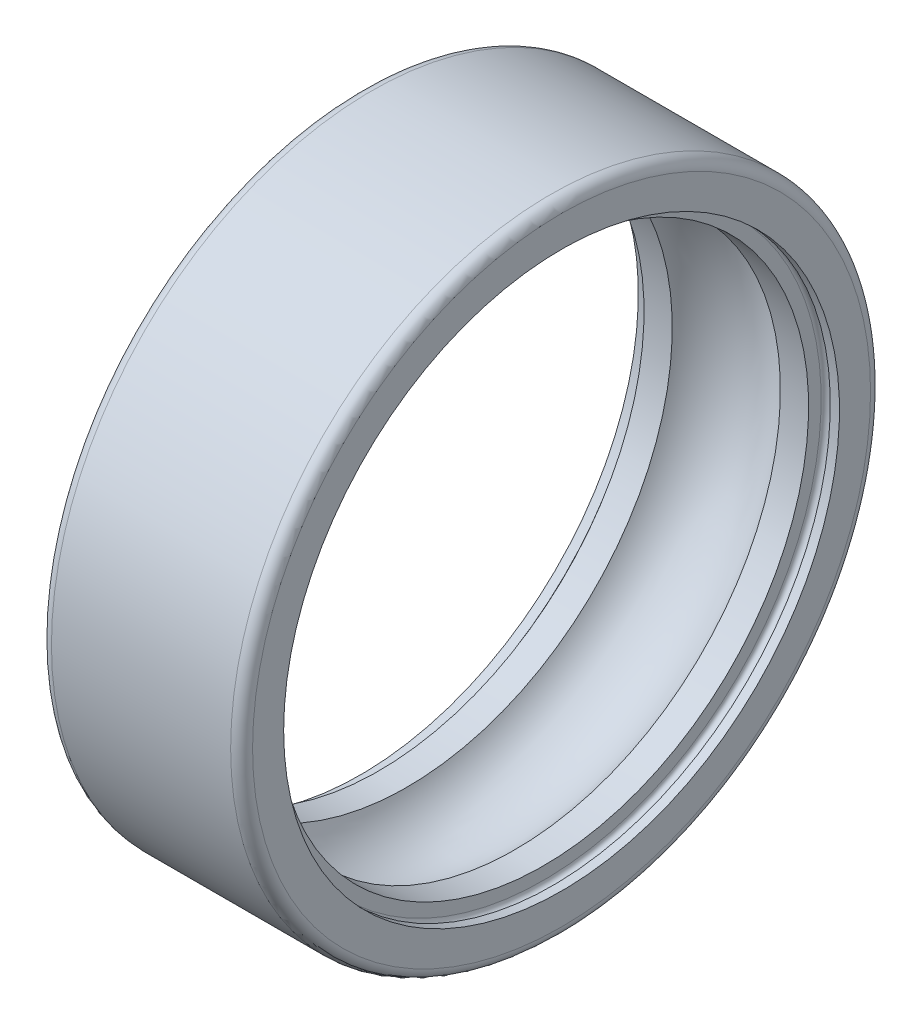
ISO-10303-21;
HEADER;
FILE_DESCRIPTION(('STEP AP214'),'2;1');
FILE_NAME('part.step','',(''),(''),'','','');
FILE_SCHEMA(('AUTOMOTIVE_DESIGN { 1 0 10303 214 1 1 1 1 }'));
ENDSEC;
DATA;
#1=APPLICATION_CONTEXT('core data for automotive mechanical design processes');
#2=APPLICATION_PROTOCOL_DEFINITION('international standard','automotive_design',2000,#1);
#3=PRODUCT_CONTEXT('',#1,'mechanical');
#4=PRODUCT('Part','Part','',(#3));
#5=PRODUCT_RELATED_PRODUCT_CATEGORY('part','',(#4));
#6=PRODUCT_DEFINITION_FORMATION('','',#4);
#7=PRODUCT_DEFINITION_CONTEXT('part definition',#1,'design');
#8=PRODUCT_DEFINITION('design','',#6,#7);
#9=PRODUCT_DEFINITION_SHAPE('','',#8);
#10=(LENGTH_UNIT() NAMED_UNIT(*) SI_UNIT(.MILLI.,.METRE.));
#11=(NAMED_UNIT(*) PLANE_ANGLE_UNIT() SI_UNIT($,.RADIAN.));
#12=(NAMED_UNIT(*) SI_UNIT($,.STERADIAN.) SOLID_ANGLE_UNIT());
#13=UNCERTAINTY_MEASURE_WITH_UNIT(LENGTH_MEASURE(1.E-05),#10,'distance_accuracy_value','');
#14=(GEOMETRIC_REPRESENTATION_CONTEXT(3) GLOBAL_UNCERTAINTY_ASSIGNED_CONTEXT((#13)) GLOBAL_UNIT_ASSIGNED_CONTEXT((#10,
#11,#12)) REPRESENTATION_CONTEXT('',''));
#15=CARTESIAN_POINT('',(0.,0.,0.));
#16=DIRECTION('',(0.,0.,1.));
#17=DIRECTION('',(1.,0.,0.));
#18=AXIS2_PLACEMENT_3D('',#15,#16,#17);
#19=CARTESIAN_POINT('',(0.,16.9,0.));
#20=DIRECTION('',(1.,0.,0.));
#21=DIRECTION('',(0.,0.,-1.));
#22=AXIS2_PLACEMENT_3D('',#19,#20,#21);
#23=PLANE('',#22);
#24=CARTESIAN_POINT('',(0.,0.,0.));
#25=DIRECTION('',(-1.,0.,0.));
#26=DIRECTION('',(0.,0.,1.));
#27=AXIS2_PLACEMENT_3D('',#24,#25,#26);
#28=CIRCLE('',#27,15.2);
#29=CARTESIAN_POINT('',(0.,0.,15.2));
#30=VERTEX_POINT('',#29);
#31=EDGE_CURVE('E10',#30,#30,#28,.T.);
#32=ORIENTED_EDGE('',*,*,#31,.F.);
#33=EDGE_LOOP('',(#32));
#34=FACE_BOUND('',#33,.T.);
#35=CARTESIAN_POINT('',(0.,0.,0.));
#36=DIRECTION('',(-1.,0.,0.));
#37=DIRECTION('',(0.,0.,1.));
#38=AXIS2_PLACEMENT_3D('',#35,#36,#37);
#39=CIRCLE('',#38,16.9);
#40=CARTESIAN_POINT('',(0.,0.,16.9));
#41=VERTEX_POINT('',#40);
#42=EDGE_CURVE('E60',#41,#41,#39,.T.);
#43=ORIENTED_EDGE('',*,*,#42,.T.);
#44=EDGE_LOOP('',(#43));
#45=FACE_BOUND('',#44,.T.);
#46=ADVANCED_FACE('F14',(#34,#45),#23,.F.);
#47=CARTESIAN_POINT('',(0.,0.,0.));
#48=DIRECTION('',(-1.,0.,0.));
#49=DIRECTION('',(0.,0.,1.));
#50=AXIS2_PLACEMENT_3D('',#47,#48,#49);
#51=CYLINDRICAL_SURFACE('',#50,15.2);
#52=CARTESIAN_POINT('',(0.5,0.,0.));
#53=DIRECTION('',(-1.,0.,0.));
#54=DIRECTION('',(0.,0.,1.));
#55=AXIS2_PLACEMENT_3D('',#52,#53,#54);
#56=CIRCLE('',#55,15.2);
#57=CARTESIAN_POINT('',(0.5,0.,15.2));
#58=VERTEX_POINT('',#57);
#59=EDGE_CURVE('E20',#58,#58,#56,.T.);
#60=ORIENTED_EDGE('',*,*,#59,.F.);
#61=EDGE_LOOP('',(#60));
#62=FACE_BOUND('',#61,.T.);
#63=ORIENTED_EDGE('',*,*,#31,.T.);
#64=EDGE_LOOP('',(#63));
#65=FACE_BOUND('',#64,.T.);
#66=ADVANCED_FACE('F108',(#62,#65),#51,.F.);
#67=CARTESIAN_POINT('',(0.75,0.,0.));
#68=DIRECTION('',(-1.,0.,0.));
#69=DIRECTION('',(0.,0.,1.));
#70=AXIS2_PLACEMENT_3D('',#67,#68,#69);
#71=TOROIDAL_SURFACE('',#70,15.2,0.25);
#72=ORIENTED_EDGE('',*,*,#59,.T.);
#73=EDGE_LOOP('',(#72));
#74=FACE_BOUND('',#73,.T.);
#75=CARTESIAN_POINT('',(1.,0.,0.));
#76=DIRECTION('',(-1.,0.,0.));
#77=DIRECTION('',(0.,0.,1.));
#78=AXIS2_PLACEMENT_3D('',#75,#76,#77);
#79=CIRCLE('',#78,15.2);
#80=CARTESIAN_POINT('',(1.,0.,15.2));
#81=VERTEX_POINT('',#80);
#82=EDGE_CURVE('E24',#81,#81,#79,.T.);
#83=ORIENTED_EDGE('',*,*,#82,.F.);
#84=EDGE_LOOP('',(#83));
#85=FACE_BOUND('',#84,.T.);
#86=ADVANCED_FACE('F113',(#74,#85),#71,.F.);
#87=CARTESIAN_POINT('',(1.,15.2,0.));
#88=DIRECTION('',(1.,0.,0.));
#89=DIRECTION('',(0.,0.,-1.));
#90=AXIS2_PLACEMENT_3D('',#87,#88,#89);
#91=PLANE('',#90);
#92=CARTESIAN_POINT('',(1.,0.,0.));
#93=DIRECTION('',(-1.,0.,0.));
#94=DIRECTION('',(0.,0.,1.));
#95=AXIS2_PLACEMENT_3D('',#92,#93,#94);
#96=CIRCLE('',#95,14.5125);
#97=CARTESIAN_POINT('',(1.,0.,14.5125));
#98=VERTEX_POINT('',#97);
#99=EDGE_CURVE('E28',#98,#98,#96,.T.);
#100=ORIENTED_EDGE('',*,*,#99,.F.);
#101=EDGE_LOOP('',(#100));
#102=FACE_BOUND('',#101,.T.);
#103=ORIENTED_EDGE('',*,*,#82,.T.);
#104=EDGE_LOOP('',(#103));
#105=FACE_BOUND('',#104,.T.);
#106=ADVANCED_FACE('F118',(#102,#105),#91,.F.);
#107=CARTESIAN_POINT('',(0.,0.,0.));
#108=DIRECTION('',(-1.,0.,0.));
#109=DIRECTION('',(0.,0.,1.));
#110=AXIS2_PLACEMENT_3D('',#107,#108,#109);
#111=CYLINDRICAL_SURFACE('',#110,14.5125);
#112=CARTESIAN_POINT('',(2.54243261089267,0.,0.));
#113=DIRECTION('',(-1.,0.,0.));
#114=DIRECTION('',(0.,0.,1.));
#115=AXIS2_PLACEMENT_3D('',#112,#113,#114);
#116=CIRCLE('',#115,14.5125);
#117=CARTESIAN_POINT('',(2.54243261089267,0.,14.5125));
#118=VERTEX_POINT('',#117);
#119=EDGE_CURVE('E33',#118,#118,#116,.T.);
#120=ORIENTED_EDGE('',*,*,#119,.F.);
#121=EDGE_LOOP('',(#120));
#122=FACE_BOUND('',#121,.T.);
#123=ORIENTED_EDGE('',*,*,#99,.T.);
#124=EDGE_LOOP('',(#123));
#125=FACE_BOUND('',#124,.T.);
#126=ADVANCED_FACE('F123',(#122,#125),#111,.F.);
#127=CARTESIAN_POINT('',(5.5,0.,0.));
#128=DIRECTION('',(-1.,0.,0.));
#129=DIRECTION('',(0.,0.,1.));
#130=AXIS2_PLACEMENT_3D('',#127,#128,#129);
#131=TOROIDAL_SURFACE('',#130,12.975,3.33333333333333);
#132=ORIENTED_EDGE('',*,*,#119,.T.);
#133=EDGE_LOOP('',(#132));
#134=FACE_BOUND('',#133,.T.);
#135=CARTESIAN_POINT('',(8.45756738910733,0.,0.));
#136=DIRECTION('',(-1.,0.,0.));
#137=DIRECTION('',(0.,0.,1.));
#138=AXIS2_PLACEMENT_3D('',#135,#136,#137);
#139=CIRCLE('',#138,14.5125);
#140=CARTESIAN_POINT('',(8.45756738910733,0.,14.5125));
#141=VERTEX_POINT('',#140);
#142=EDGE_CURVE('E36',#141,#141,#139,.T.);
#143=ORIENTED_EDGE('',*,*,#142,.F.);
#144=EDGE_LOOP('',(#143));
#145=FACE_BOUND('',#144,.T.);
#146=ADVANCED_FACE('F127',(#134,#145),#131,.F.);
#147=CARTESIAN_POINT('',(0.,0.,0.));
#148=DIRECTION('',(-1.,0.,0.));
#149=DIRECTION('',(0.,0.,1.));
#150=AXIS2_PLACEMENT_3D('',#147,#148,#149);
#151=CYLINDRICAL_SURFACE('',#150,14.5125);
#152=CARTESIAN_POINT('',(10.,0.,0.));
#153=DIRECTION('',(-1.,0.,0.));
#154=DIRECTION('',(0.,0.,1.));
#155=AXIS2_PLACEMENT_3D('',#152,#153,#154);
#156=CIRCLE('',#155,14.5125);
#157=CARTESIAN_POINT('',(10.,0.,14.5125));
#158=VERTEX_POINT('',#157);
#159=EDGE_CURVE('E39',#158,#158,#156,.T.);
#160=ORIENTED_EDGE('',*,*,#159,.F.);
#161=EDGE_LOOP('',(#160));
#162=FACE_BOUND('',#161,.T.);
#163=ORIENTED_EDGE('',*,*,#142,.T.);
#164=EDGE_LOOP('',(#163));
#165=FACE_BOUND('',#164,.T.);
#166=ADVANCED_FACE('F104',(#162,#165),#151,.F.);
#167=CARTESIAN_POINT('',(10.,14.5125,0.));
#168=DIRECTION('',(-1.,0.,0.));
#169=DIRECTION('',(0.,0.,1.));
#170=AXIS2_PLACEMENT_3D('',#167,#168,#169);
#171=PLANE('',#170);
#172=CARTESIAN_POINT('',(10.,0.,0.));
#173=DIRECTION('',(-1.,0.,0.));
#174=DIRECTION('',(0.,0.,1.));
#175=AXIS2_PLACEMENT_3D('',#172,#173,#174);
#176=CIRCLE('',#175,15.2);
#177=CARTESIAN_POINT('',(10.,0.,15.2));
#178=VERTEX_POINT('',#177);
#179=EDGE_CURVE('E42',#178,#178,#176,.T.);
#180=ORIENTED_EDGE('',*,*,#179,.F.);
#181=EDGE_LOOP('',(#180));
#182=FACE_BOUND('',#181,.T.);
#183=ORIENTED_EDGE('',*,*,#159,.T.);
#184=EDGE_LOOP('',(#183));
#185=FACE_BOUND('',#184,.T.);
#186=ADVANCED_FACE('F97',(#182,#185),#171,.F.);
#187=CARTESIAN_POINT('',(10.25,0.,0.));
#188=DIRECTION('',(-1.,0.,0.));
#189=DIRECTION('',(0.,0.,1.));
#190=AXIS2_PLACEMENT_3D('',#187,#188,#189);
#191=TOROIDAL_SURFACE('',#190,15.2,0.25);
#192=ORIENTED_EDGE('',*,*,#179,.T.);
#193=EDGE_LOOP('',(#192));
#194=FACE_BOUND('',#193,.T.);
#195=CARTESIAN_POINT('',(10.5,0.,0.));
#196=DIRECTION('',(-1.,0.,0.));
#197=DIRECTION('',(0.,0.,1.));
#198=AXIS2_PLACEMENT_3D('',#195,#196,#197);
#199=CIRCLE('',#198,15.2);
#200=CARTESIAN_POINT('',(10.5,0.,15.2));
#201=VERTEX_POINT('',#200);
#202=EDGE_CURVE('E45',#201,#201,#199,.T.);
#203=ORIENTED_EDGE('',*,*,#202,.F.);
#204=EDGE_LOOP('',(#203));
#205=FACE_BOUND('',#204,.T.);
#206=ADVANCED_FACE('F92',(#194,#205),#191,.F.);
#207=CARTESIAN_POINT('',(0.,0.,0.));
#208=DIRECTION('',(-1.,0.,0.));
#209=DIRECTION('',(0.,0.,1.));
#210=AXIS2_PLACEMENT_3D('',#207,#208,#209);
#211=CYLINDRICAL_SURFACE('',#210,15.2);
#212=CARTESIAN_POINT('',(11.,0.,0.));
#213=DIRECTION('',(-1.,0.,0.));
#214=DIRECTION('',(0.,0.,1.));
#215=AXIS2_PLACEMENT_3D('',#212,#213,#214);
#216=CIRCLE('',#215,15.2);
#217=CARTESIAN_POINT('',(11.,0.,15.2));
#218=VERTEX_POINT('',#217);
#219=EDGE_CURVE('E48',#218,#218,#216,.T.);
#220=ORIENTED_EDGE('',*,*,#219,.F.);
#221=EDGE_LOOP('',(#220));
#222=FACE_BOUND('',#221,.T.);
#223=ORIENTED_EDGE('',*,*,#202,.T.);
#224=EDGE_LOOP('',(#223));
#225=FACE_BOUND('',#224,.T.);
#226=ADVANCED_FACE('F86',(#222,#225),#211,.F.);
#227=CARTESIAN_POINT('',(11.,15.2,0.));
#228=DIRECTION('',(-1.,0.,0.));
#229=DIRECTION('',(0.,0.,1.));
#230=AXIS2_PLACEMENT_3D('',#227,#228,#229);
#231=PLANE('',#230);
#232=CARTESIAN_POINT('',(11.,0.,0.));
#233=DIRECTION('',(-1.,0.,0.));
#234=DIRECTION('',(0.,0.,1.));
#235=AXIS2_PLACEMENT_3D('',#232,#233,#234);
#236=CIRCLE('',#235,16.9);
#237=CARTESIAN_POINT('',(11.,0.,16.9));
#238=VERTEX_POINT('',#237);
#239=EDGE_CURVE('E51',#238,#238,#236,.T.);
#240=ORIENTED_EDGE('',*,*,#239,.F.);
#241=EDGE_LOOP('',(#240));
#242=FACE_BOUND('',#241,.T.);
#243=ORIENTED_EDGE('',*,*,#219,.T.);
#244=EDGE_LOOP('',(#243));
#245=FACE_BOUND('',#244,.T.);
#246=ADVANCED_FACE('F80',(#242,#245),#231,.F.);
#247=CARTESIAN_POINT('',(10.4,0.,0.));
#248=DIRECTION('',(-1.,0.,0.));
#249=DIRECTION('',(0.,0.,1.));
#250=AXIS2_PLACEMENT_3D('',#247,#248,#249);
#251=TOROIDAL_SURFACE('',#250,16.9,0.6);
#252=CARTESIAN_POINT('',(10.4,0.,0.));
#253=DIRECTION('',(-1.,0.,0.));
#254=DIRECTION('',(0.,0.,1.));
#255=AXIS2_PLACEMENT_3D('',#252,#253,#254);
#256=CIRCLE('',#255,17.5);
#257=CARTESIAN_POINT('',(10.4,0.,17.5));
#258=VERTEX_POINT('',#257);
#259=EDGE_CURVE('E54',#258,#258,#256,.T.);
#260=ORIENTED_EDGE('',*,*,#259,.F.);
#261=EDGE_LOOP('',(#260));
#262=FACE_BOUND('',#261,.T.);
#263=ORIENTED_EDGE('',*,*,#239,.T.);
#264=EDGE_LOOP('',(#263));
#265=FACE_BOUND('',#264,.T.);
#266=ADVANCED_FACE('F74',(#262,#265),#251,.T.);
#267=CARTESIAN_POINT('',(0.,0.,0.));
#268=DIRECTION('',(-1.,0.,0.));
#269=DIRECTION('',(0.,0.,1.));
#270=AXIS2_PLACEMENT_3D('',#267,#268,#269);
#271=CYLINDRICAL_SURFACE('',#270,17.5);
#272=CARTESIAN_POINT('',(0.6,0.,0.));
#273=DIRECTION('',(-1.,0.,0.));
#274=DIRECTION('',(0.,0.,1.));
#275=AXIS2_PLACEMENT_3D('',#272,#273,#274);
#276=CIRCLE('',#275,17.5);
#277=CARTESIAN_POINT('',(0.6,0.,17.5));
#278=VERTEX_POINT('',#277);
#279=EDGE_CURVE('E57',#278,#278,#276,.T.);
#280=ORIENTED_EDGE('',*,*,#279,.F.);
#281=EDGE_LOOP('',(#280));
#282=FACE_BOUND('',#281,.T.);
#283=ORIENTED_EDGE('',*,*,#259,.T.);
#284=EDGE_LOOP('',(#283));
#285=FACE_BOUND('',#284,.T.);
#286=ADVANCED_FACE('F68',(#282,#285),#271,.T.);
#287=CARTESIAN_POINT('',(0.6,0.,0.));
#288=DIRECTION('',(-1.,0.,0.));
#289=DIRECTION('',(0.,0.,1.));
#290=AXIS2_PLACEMENT_3D('',#287,#288,#289);
#291=TOROIDAL_SURFACE('',#290,16.9,0.6);
#292=ORIENTED_EDGE('',*,*,#42,.F.);
#293=EDGE_LOOP('',(#292));
#294=FACE_BOUND('',#293,.T.);
#295=ORIENTED_EDGE('',*,*,#279,.T.);
#296=EDGE_LOOP('',(#295));
#297=FACE_BOUND('',#296,.T.);
#298=ADVANCED_FACE('F65',(#294,#297),#291,.T.);
#299=CLOSED_SHELL('',(#46,#66,#86,#106,#126,#146,#166,#186,#206,#226,#246,#266,#286,#298));
#300=MANIFOLD_SOLID_BREP('B1',#299);
#301=ADVANCED_BREP_SHAPE_REPRESENTATION('',(#18,#300),#14);
#302=SHAPE_DEFINITION_REPRESENTATION(#9,#301);
ENDSEC;
END-ISO-10303-21;
